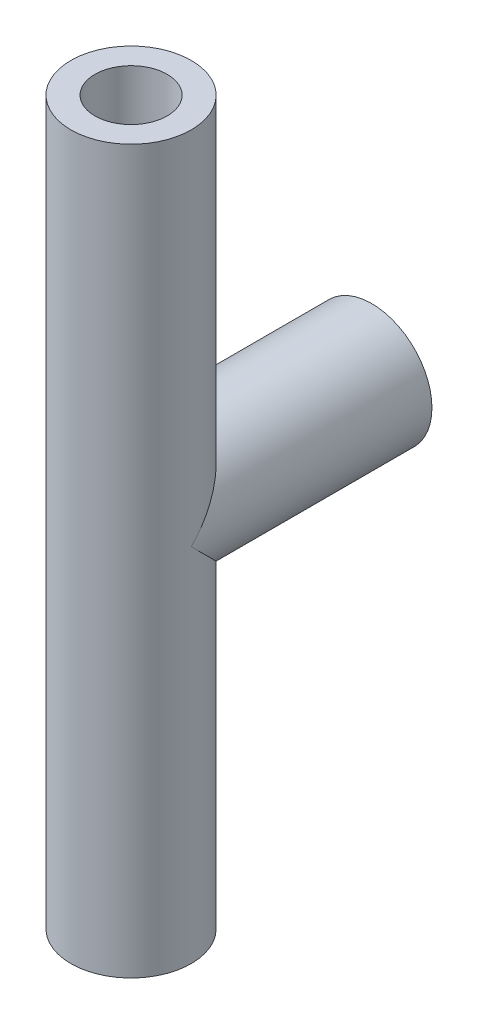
ISO-10303-21;
HEADER;
FILE_DESCRIPTION(('STEP AP214'),'2;1');
FILE_NAME('part.step','',(''),(''),'','','');
FILE_SCHEMA(('AUTOMOTIVE_DESIGN { 1 0 10303 214 1 1 1 1 }'));
ENDSEC;
DATA;
#1=APPLICATION_CONTEXT('core data for automotive mechanical design processes');
#2=APPLICATION_PROTOCOL_DEFINITION('international standard','automotive_design',2000,#1);
#3=PRODUCT_CONTEXT('',#1,'mechanical');
#4=PRODUCT('Part','Part','',(#3));
#5=PRODUCT_RELATED_PRODUCT_CATEGORY('part','',(#4));
#6=PRODUCT_DEFINITION_FORMATION('','',#4);
#7=PRODUCT_DEFINITION_CONTEXT('part definition',#1,'design');
#8=PRODUCT_DEFINITION('design','',#6,#7);
#9=PRODUCT_DEFINITION_SHAPE('','',#8);
#10=(LENGTH_UNIT() NAMED_UNIT(*) SI_UNIT(.MILLI.,.METRE.));
#11=(NAMED_UNIT(*) PLANE_ANGLE_UNIT() SI_UNIT($,.RADIAN.));
#12=(NAMED_UNIT(*) SI_UNIT($,.STERADIAN.) SOLID_ANGLE_UNIT());
#13=UNCERTAINTY_MEASURE_WITH_UNIT(LENGTH_MEASURE(1.E-05),#10,'distance_accuracy_value','');
#14=(GEOMETRIC_REPRESENTATION_CONTEXT(3) GLOBAL_UNCERTAINTY_ASSIGNED_CONTEXT((#13)) GLOBAL_UNIT_ASSIGNED_CONTEXT((#10,
#11,#12)) REPRESENTATION_CONTEXT('',''));
#15=CARTESIAN_POINT('',(0.,0.,0.));
#16=DIRECTION('',(0.,0.,1.));
#17=DIRECTION('',(1.,0.,0.));
#18=AXIS2_PLACEMENT_3D('',#15,#16,#17);
#19=CARTESIAN_POINT('',(57.1499999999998,0.,25.4));
#20=DIRECTION('',(0.,0.,-1.));
#21=DIRECTION('',(-1.,0.,0.));
#22=AXIS2_PLACEMENT_3D('',#19,#20,#21);
#23=CYLINDRICAL_SURFACE('',#22,6.35);
#24=CARTESIAN_POINT('',(57.1499999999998,0.,0.));
#25=DIRECTION('',(0.,0.,1.));
#26=DIRECTION('',(1.,0.,0.));
#27=AXIS2_PLACEMENT_3D('',#24,#25,#26);
#28=CIRCLE('',#27,6.35);
#29=CARTESIAN_POINT('',(63.4999999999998,0.,0.));
#30=VERTEX_POINT('',#29);
#31=EDGE_CURVE('E11',#30,#30,#28,.T.);
#32=ORIENTED_EDGE('',*,*,#31,.T.);
#33=EDGE_LOOP('',(#32));
#34=FACE_BOUND('',#33,.T.);
#35=CARTESIAN_POINT('',(57.1499999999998,0.,25.4));
#36=DIRECTION('',(0.,-0.707106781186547,-0.707106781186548));
#37=DIRECTION('',(0.,0.707106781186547,-0.707106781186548));
#38=AXIS2_PLACEMENT_3D('',#35,#36,#37);
#39=ELLIPSE('',#38,8.98025612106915,6.35);
#40=CARTESIAN_POINT('',(63.4999999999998,0.,25.4));
#41=VERTEX_POINT('',#40);
#42=CARTESIAN_POINT('',(50.7999999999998,0.,25.4));
#43=VERTEX_POINT('',#42);
#44=EDGE_CURVE('E38',#41,#43,#39,.F.);
#45=ORIENTED_EDGE('',*,*,#44,.F.);
#46=CARTESIAN_POINT('',(57.1499999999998,0.,25.4));
#47=DIRECTION('',(0.,0.707106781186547,-0.707106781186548));
#48=DIRECTION('',(0.,-0.707106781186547,-0.707106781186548));
#49=AXIS2_PLACEMENT_3D('',#46,#47,#48);
#50=ELLIPSE('',#49,8.98025612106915,6.35);
#51=EDGE_CURVE('E44',#43,#41,#50,.F.);
#52=ORIENTED_EDGE('',*,*,#51,.F.);
#53=EDGE_LOOP('',(#45,#52));
#54=FACE_BOUND('',#53,.T.);
#55=ADVANCED_FACE('F31',(#34,#54),#23,.T.);
#56=CARTESIAN_POINT('',(57.1499999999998,0.,0.));
#57=DIRECTION('',(0.,0.,1.));
#58=DIRECTION('',(1.,0.,0.));
#59=AXIS2_PLACEMENT_3D('',#56,#57,#58);
#60=PLANE('',#59);
#61=CARTESIAN_POINT('',(57.1499999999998,0.,0.));
#62=DIRECTION('',(0.,0.,1.));
#63=DIRECTION('',(1.,0.,0.));
#64=AXIS2_PLACEMENT_3D('',#61,#62,#63);
#65=CIRCLE('',#64,3.81);
#66=CARTESIAN_POINT('',(60.9599999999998,0.,0.));
#67=VERTEX_POINT('',#66);
#68=EDGE_CURVE('E59',#67,#67,#65,.T.);
#69=ORIENTED_EDGE('',*,*,#68,.T.);
#70=EDGE_LOOP('',(#69));
#71=FACE_BOUND('',#70,.T.);
#72=ORIENTED_EDGE('',*,*,#31,.F.);
#73=EDGE_LOOP('',(#72));
#74=FACE_BOUND('',#73,.T.);
#75=ADVANCED_FACE('F82',(#71,#74),#60,.F.);
#76=CARTESIAN_POINT('',(57.1499999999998,38.1,25.4));
#77=DIRECTION('',(0.,-1.,0.));
#78=DIRECTION('',(0.,0.,-1.));
#79=AXIS2_PLACEMENT_3D('',#76,#77,#78);
#80=CYLINDRICAL_SURFACE('',#79,6.35);
#81=CARTESIAN_POINT('',(57.1499999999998,-38.1,25.4));
#82=DIRECTION('',(0.,1.,0.));
#83=DIRECTION('',(0.,0.,1.));
#84=AXIS2_PLACEMENT_3D('',#81,#82,#83);
#85=CIRCLE('',#84,6.35);
#86=CARTESIAN_POINT('',(57.1499999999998,-38.1,31.75));
#87=VERTEX_POINT('',#86);
#88=EDGE_CURVE('E70',#87,#87,#85,.T.);
#89=ORIENTED_EDGE('',*,*,#88,.T.);
#90=EDGE_LOOP('',(#89));
#91=FACE_BOUND('',#90,.T.);
#92=CARTESIAN_POINT('',(57.1499999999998,38.1,25.4));
#93=DIRECTION('',(0.,1.,0.));
#94=DIRECTION('',(0.,0.,1.));
#95=AXIS2_PLACEMENT_3D('',#92,#93,#94);
#96=CIRCLE('',#95,6.35);
#97=CARTESIAN_POINT('',(57.1499999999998,38.1,31.75));
#98=VERTEX_POINT('',#97);
#99=EDGE_CURVE('E73',#98,#98,#96,.T.);
#100=ORIENTED_EDGE('',*,*,#99,.F.);
#101=EDGE_LOOP('',(#100));
#102=FACE_BOUND('',#101,.T.);
#103=ORIENTED_EDGE('',*,*,#51,.T.);
#104=ORIENTED_EDGE('',*,*,#44,.T.);
#105=EDGE_LOOP('',(#103,#104));
#106=FACE_BOUND('',#105,.T.);
#107=ADVANCED_FACE('F79',(#91,#102,#106),#80,.T.);
#108=CARTESIAN_POINT('',(57.1499999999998,38.1,25.4));
#109=DIRECTION('',(0.,1.,0.));
#110=DIRECTION('',(0.,0.,1.));
#111=AXIS2_PLACEMENT_3D('',#108,#109,#110);
#112=PLANE('',#111);
#113=CARTESIAN_POINT('',(57.1499999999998,38.1,25.4));
#114=DIRECTION('',(0.,1.,0.));
#115=DIRECTION('',(0.,0.,1.));
#116=AXIS2_PLACEMENT_3D('',#113,#114,#115);
#117=CIRCLE('',#116,3.81);
#118=CARTESIAN_POINT('',(57.1499999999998,38.1,29.21));
#119=VERTEX_POINT('',#118);
#120=EDGE_CURVE('E62',#119,#119,#117,.T.);
#121=ORIENTED_EDGE('',*,*,#120,.F.);
#122=EDGE_LOOP('',(#121));
#123=FACE_BOUND('',#122,.T.);
#124=ORIENTED_EDGE('',*,*,#99,.T.);
#125=EDGE_LOOP('',(#124));
#126=FACE_BOUND('',#125,.T.);
#127=ADVANCED_FACE('F81',(#123,#126),#112,.T.);
#128=CARTESIAN_POINT('',(57.1499999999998,-38.1,25.4));
#129=DIRECTION('',(0.,1.,0.));
#130=DIRECTION('',(0.,0.,1.));
#131=AXIS2_PLACEMENT_3D('',#128,#129,#130);
#132=PLANE('',#131);
#133=CARTESIAN_POINT('',(57.1499999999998,-38.1,25.4));
#134=DIRECTION('',(0.,1.,0.));
#135=DIRECTION('',(0.,0.,1.));
#136=AXIS2_PLACEMENT_3D('',#133,#134,#135);
#137=CIRCLE('',#136,3.81);
#138=CARTESIAN_POINT('',(57.1499999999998,-38.1,29.21));
#139=VERTEX_POINT('',#138);
#140=EDGE_CURVE('E65',#139,#139,#137,.T.);
#141=ORIENTED_EDGE('',*,*,#140,.T.);
#142=EDGE_LOOP('',(#141));
#143=FACE_BOUND('',#142,.T.);
#144=ORIENTED_EDGE('',*,*,#88,.F.);
#145=EDGE_LOOP('',(#144));
#146=FACE_BOUND('',#145,.T.);
#147=ADVANCED_FACE('F89',(#143,#146),#132,.F.);
#148=CARTESIAN_POINT('',(57.1499999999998,0.,25.4));
#149=DIRECTION('',(0.,0.,-1.));
#150=DIRECTION('',(-1.,0.,0.));
#151=AXIS2_PLACEMENT_3D('',#148,#149,#150);
#152=CYLINDRICAL_SURFACE('',#151,3.81);
#153=ORIENTED_EDGE('',*,*,#68,.F.);
#154=EDGE_LOOP('',(#153));
#155=FACE_BOUND('',#154,.T.);
#156=CARTESIAN_POINT('',(57.1499999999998,0.,25.4));
#157=DIRECTION('',(0.,-0.707106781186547,-0.707106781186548));
#158=DIRECTION('',(0.,0.707106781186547,-0.707106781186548));
#159=AXIS2_PLACEMENT_3D('',#156,#157,#158);
#160=ELLIPSE('',#159,5.38815367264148,3.81);
#161=CARTESIAN_POINT('',(60.9599999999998,0.,25.4));
#162=VERTEX_POINT('',#161);
#163=CARTESIAN_POINT('',(53.3399999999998,0.,25.4));
#164=VERTEX_POINT('',#163);
#165=EDGE_CURVE('E54',#162,#164,#160,.F.);
#166=ORIENTED_EDGE('',*,*,#165,.T.);
#167=CARTESIAN_POINT('',(57.1499999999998,0.,25.4));
#168=DIRECTION('',(0.,0.707106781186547,-0.707106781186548));
#169=DIRECTION('',(0.,-0.707106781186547,-0.707106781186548));
#170=AXIS2_PLACEMENT_3D('',#167,#168,#169);
#171=ELLIPSE('',#170,5.38815367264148,3.81);
#172=EDGE_CURVE('E57',#164,#162,#171,.F.);
#173=ORIENTED_EDGE('',*,*,#172,.T.);
#174=EDGE_LOOP('',(#166,#173));
#175=FACE_BOUND('',#174,.T.);
#176=ADVANCED_FACE('F61',(#155,#175),#152,.F.);
#177=CARTESIAN_POINT('',(57.1499999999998,38.1,25.4));
#178=DIRECTION('',(0.,-1.,0.));
#179=DIRECTION('',(0.,0.,-1.));
#180=AXIS2_PLACEMENT_3D('',#177,#178,#179);
#181=CYLINDRICAL_SURFACE('',#180,3.81);
#182=ORIENTED_EDGE('',*,*,#140,.F.);
#183=EDGE_LOOP('',(#182));
#184=FACE_BOUND('',#183,.T.);
#185=ORIENTED_EDGE('',*,*,#120,.T.);
#186=EDGE_LOOP('',(#185));
#187=FACE_BOUND('',#186,.T.);
#188=ORIENTED_EDGE('',*,*,#172,.F.);
#189=ORIENTED_EDGE('',*,*,#165,.F.);
#190=EDGE_LOOP('',(#188,#189));
#191=FACE_BOUND('',#190,.T.);
#192=ADVANCED_FACE('F56',(#184,#187,#191),#181,.F.);
#193=CLOSED_SHELL('',(#55,#75,#107,#127,#147,#176,#192));
#194=MANIFOLD_SOLID_BREP('B2',#193);
#195=ADVANCED_BREP_SHAPE_REPRESENTATION('',(#18,#194),#14);
#196=SHAPE_DEFINITION_REPRESENTATION(#9,#195);
ENDSEC;
END-ISO-10303-21;
